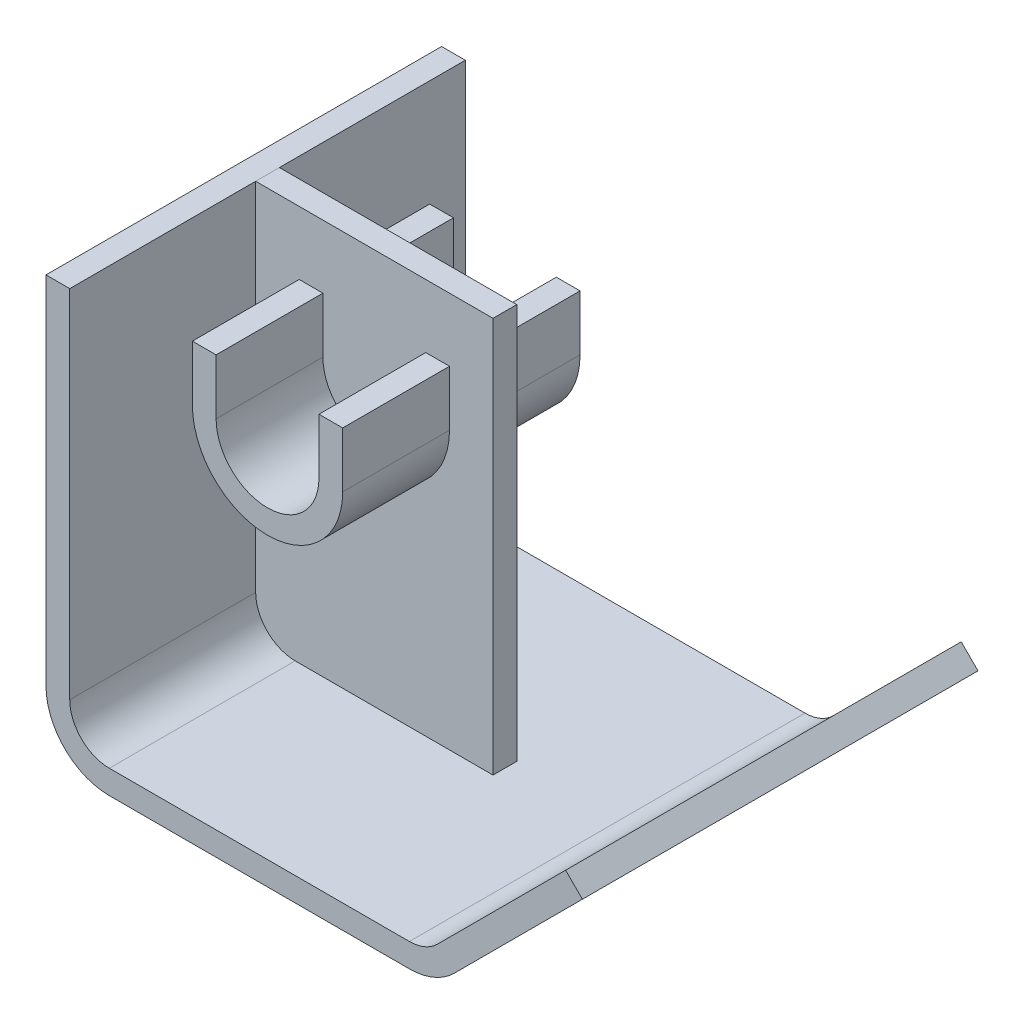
ISO-10303-21;
HEADER;
FILE_DESCRIPTION(('STEP AP214'),'2;1');
FILE_NAME('part.step','',(''),(''),'','','');
FILE_SCHEMA(('AUTOMOTIVE_DESIGN { 1 0 10303 214 1 1 1 1 }'));
ENDSEC;
DATA;
#1=APPLICATION_CONTEXT('core data for automotive mechanical design processes');
#2=APPLICATION_PROTOCOL_DEFINITION('international standard','automotive_design',2000,#1);
#3=PRODUCT_CONTEXT('',#1,'mechanical');
#4=PRODUCT('Part','Part','',(#3));
#5=PRODUCT_RELATED_PRODUCT_CATEGORY('part','',(#4));
#6=PRODUCT_DEFINITION_FORMATION('','',#4);
#7=PRODUCT_DEFINITION_CONTEXT('part definition',#1,'design');
#8=PRODUCT_DEFINITION('design','',#6,#7);
#9=PRODUCT_DEFINITION_SHAPE('','',#8);
#10=(LENGTH_UNIT() NAMED_UNIT(*) SI_UNIT(.MILLI.,.METRE.));
#11=(NAMED_UNIT(*) PLANE_ANGLE_UNIT() SI_UNIT($,.RADIAN.));
#12=(NAMED_UNIT(*) SI_UNIT($,.STERADIAN.) SOLID_ANGLE_UNIT());
#13=UNCERTAINTY_MEASURE_WITH_UNIT(LENGTH_MEASURE(1.E-05),#10,'distance_accuracy_value','');
#14=(GEOMETRIC_REPRESENTATION_CONTEXT(3) GLOBAL_UNCERTAINTY_ASSIGNED_CONTEXT((#13)) GLOBAL_UNIT_ASSIGNED_CONTEXT((#10,
#11,#12)) REPRESENTATION_CONTEXT('',''));
#15=CARTESIAN_POINT('',(0.,0.,0.));
#16=DIRECTION('',(0.,0.,1.));
#17=DIRECTION('',(1.,0.,0.));
#18=AXIS2_PLACEMENT_3D('',#15,#16,#17);
#19=CARTESIAN_POINT('',(24.5,35.,15.));
#20=DIRECTION('',(-1.,0.,0.));
#21=DIRECTION('',(0.,0.,1.));
#22=AXIS2_PLACEMENT_3D('',#19,#20,#21);
#23=PLANE('',#22);
#24=DIRECTION('',(0.,1.,0.));
#25=VECTOR('',#24,1.);
#26=CARTESIAN_POINT('',(24.5,35.,-15.));
#27=LINE('',#26,#25);
#28=CARTESIAN_POINT('',(24.5,35.,-15.));
#29=VERTEX_POINT('',#28);
#30=CARTESIAN_POINT('',(24.5,42.,-15.));
#31=VERTEX_POINT('',#30);
#32=EDGE_CURVE('E119',#29,#31,#27,.T.);
#33=ORIENTED_EDGE('',*,*,#32,.T.);
#34=DIRECTION('',(0.,0.,-1.));
#35=VECTOR('',#34,1.);
#36=CARTESIAN_POINT('',(24.5,42.,15.));
#37=LINE('',#36,#35);
#38=CARTESIAN_POINT('',(24.5,42.,15.));
#39=VERTEX_POINT('',#38);
#40=EDGE_CURVE('E12',#39,#31,#37,.T.);
#41=ORIENTED_EDGE('',*,*,#40,.F.);
#42=DIRECTION('',(0.,1.,0.));
#43=VECTOR('',#42,1.);
#44=CARTESIAN_POINT('',(24.5,35.,15.));
#45=LINE('',#44,#43);
#46=CARTESIAN_POINT('',(24.5,35.,15.));
#47=VERTEX_POINT('',#46);
#48=EDGE_CURVE('E143',#47,#39,#45,.T.);
#49=ORIENTED_EDGE('',*,*,#48,.F.);
#50=DIRECTION('',(0.,0.,-1.));
#51=VECTOR('',#50,1.);
#52=CARTESIAN_POINT('',(24.5,35.,15.));
#53=LINE('',#52,#51);
#54=EDGE_CURVE('E120',#47,#29,#53,.T.);
#55=ORIENTED_EDGE('',*,*,#54,.T.);
#56=EDGE_LOOP('',(#33,#41,#49,#55));
#57=FACE_BOUND('',#56,.T.);
#58=ADVANCED_FACE('F44',(#57),#23,.F.);
#59=CARTESIAN_POINT('',(21.5,42.,15.));
#60=DIRECTION('',(0.,1.,0.));
#61=DIRECTION('',(0.,0.,1.));
#62=AXIS2_PLACEMENT_3D('',#59,#60,#61);
#63=PLANE('',#62);
#64=DIRECTION('',(1.,0.,0.));
#65=VECTOR('',#64,1.);
#66=CARTESIAN_POINT('',(21.5,42.,-15.));
#67=LINE('',#66,#65);
#68=CARTESIAN_POINT('',(21.5,42.,-15.));
#69=VERTEX_POINT('',#68);
#70=EDGE_CURVE('E111',#69,#31,#67,.T.);
#71=ORIENTED_EDGE('',*,*,#70,.F.);
#72=DIRECTION('',(0.,0.,-1.));
#73=VECTOR('',#72,1.);
#74=CARTESIAN_POINT('',(21.5,42.,15.));
#75=LINE('',#74,#73);
#76=CARTESIAN_POINT('',(21.5,42.,15.));
#77=VERTEX_POINT('',#76);
#78=EDGE_CURVE('E51',#77,#69,#75,.T.);
#79=ORIENTED_EDGE('',*,*,#78,.F.);
#80=DIRECTION('',(1.,0.,0.));
#81=VECTOR('',#80,1.);
#82=CARTESIAN_POINT('',(21.5,42.,15.));
#83=LINE('',#82,#81);
#84=EDGE_CURVE('E114',#77,#39,#83,.T.);
#85=ORIENTED_EDGE('',*,*,#84,.T.);
#86=ORIENTED_EDGE('',*,*,#40,.T.);
#87=EDGE_LOOP('',(#71,#79,#85,#86));
#88=FACE_BOUND('',#87,.T.);
#89=ADVANCED_FACE('F109',(#88),#63,.T.);
#90=CARTESIAN_POINT('',(21.5,35.,15.));
#91=DIRECTION('',(-1.,0.,0.));
#92=DIRECTION('',(0.,0.,1.));
#93=AXIS2_PLACEMENT_3D('',#90,#91,#92);
#94=PLANE('',#93);
#95=DIRECTION('',(0.,1.,0.));
#96=VECTOR('',#95,1.);
#97=CARTESIAN_POINT('',(21.5,35.,-15.));
#98=LINE('',#97,#96);
#99=CARTESIAN_POINT('',(21.5,35.,-15.));
#100=VERTEX_POINT('',#99);
#101=EDGE_CURVE('E127',#100,#69,#98,.T.);
#102=ORIENTED_EDGE('',*,*,#101,.F.);
#103=DIRECTION('',(0.,0.,-1.));
#104=VECTOR('',#103,1.);
#105=CARTESIAN_POINT('',(21.5,35.,15.));
#106=LINE('',#105,#104);
#107=CARTESIAN_POINT('',(21.5,35.,15.));
#108=VERTEX_POINT('',#107);
#109=EDGE_CURVE('E170',#108,#100,#106,.T.);
#110=ORIENTED_EDGE('',*,*,#109,.F.);
#111=DIRECTION('',(0.,1.,0.));
#112=VECTOR('',#111,1.);
#113=CARTESIAN_POINT('',(21.5,35.,15.));
#114=LINE('',#113,#112);
#115=EDGE_CURVE('E146',#108,#77,#114,.T.);
#116=ORIENTED_EDGE('',*,*,#115,.T.);
#117=ORIENTED_EDGE('',*,*,#78,.T.);
#118=EDGE_LOOP('',(#102,#110,#116,#117));
#119=FACE_BOUND('',#118,.T.);
#120=ADVANCED_FACE('F172',(#119),#94,.T.);
#121=CARTESIAN_POINT('',(15.,35.,15.));
#122=DIRECTION('',(0.,0.,-1.));
#123=DIRECTION('',(-1.,0.,0.));
#124=AXIS2_PLACEMENT_3D('',#121,#122,#123);
#125=CYLINDRICAL_SURFACE('',#124,6.5);
#126=CARTESIAN_POINT('',(15.,35.,-15.));
#127=DIRECTION('',(0.,0.,1.));
#128=DIRECTION('',(1.,0.,0.));
#129=AXIS2_PLACEMENT_3D('',#126,#127,#128);
#130=CIRCLE('',#129,6.5);
#131=CARTESIAN_POINT('',(8.5,35.,-15.));
#132=VERTEX_POINT('',#131);
#133=EDGE_CURVE('E129',#132,#100,#130,.T.);
#134=ORIENTED_EDGE('',*,*,#133,.F.);
#135=DIRECTION('',(0.,0.,-1.));
#136=VECTOR('',#135,1.);
#137=CARTESIAN_POINT('',(8.5,35.,15.));
#138=LINE('',#137,#136);
#139=CARTESIAN_POINT('',(8.5,35.,15.));
#140=VERTEX_POINT('',#139);
#141=EDGE_CURVE('E168',#140,#132,#138,.T.);
#142=ORIENTED_EDGE('',*,*,#141,.F.);
#143=CARTESIAN_POINT('',(15.,35.,15.));
#144=DIRECTION('',(0.,0.,1.));
#145=DIRECTION('',(1.,0.,0.));
#146=AXIS2_PLACEMENT_3D('',#143,#144,#145);
#147=CIRCLE('',#146,6.5);
#148=EDGE_CURVE('E149',#140,#108,#147,.T.);
#149=ORIENTED_EDGE('',*,*,#148,.T.);
#150=ORIENTED_EDGE('',*,*,#109,.T.);
#151=EDGE_LOOP('',(#134,#142,#149,#150));
#152=FACE_BOUND('',#151,.T.);
#153=ADVANCED_FACE('F179',(#152),#125,.F.);
#154=CARTESIAN_POINT('',(8.5,42.,15.));
#155=DIRECTION('',(1.,0.,0.));
#156=DIRECTION('',(0.,1.,0.));
#157=AXIS2_PLACEMENT_3D('',#154,#155,#156);
#158=PLANE('',#157);
#159=DIRECTION('',(0.,-1.,0.));
#160=VECTOR('',#159,1.);
#161=CARTESIAN_POINT('',(8.5,42.,-15.));
#162=LINE('',#161,#160);
#163=CARTESIAN_POINT('',(8.5,42.,-15.));
#164=VERTEX_POINT('',#163);
#165=EDGE_CURVE('E133',#164,#132,#162,.T.);
#166=ORIENTED_EDGE('',*,*,#165,.F.);
#167=DIRECTION('',(0.,0.,-1.));
#168=VECTOR('',#167,1.);
#169=CARTESIAN_POINT('',(8.5,42.,15.));
#170=LINE('',#169,#168);
#171=CARTESIAN_POINT('',(8.5,42.,15.));
#172=VERTEX_POINT('',#171);
#173=EDGE_CURVE('E166',#172,#164,#170,.T.);
#174=ORIENTED_EDGE('',*,*,#173,.F.);
#175=DIRECTION('',(0.,-1.,0.));
#176=VECTOR('',#175,1.);
#177=CARTESIAN_POINT('',(8.5,42.,15.));
#178=LINE('',#177,#176);
#179=EDGE_CURVE('E152',#172,#140,#178,.T.);
#180=ORIENTED_EDGE('',*,*,#179,.T.);
#181=ORIENTED_EDGE('',*,*,#141,.T.);
#182=EDGE_LOOP('',(#166,#174,#180,#181));
#183=FACE_BOUND('',#182,.T.);
#184=ADVANCED_FACE('F182',(#183),#158,.T.);
#185=CARTESIAN_POINT('',(5.5,42.,15.));
#186=DIRECTION('',(0.,1.,0.));
#187=DIRECTION('',(0.,0.,1.));
#188=AXIS2_PLACEMENT_3D('',#185,#186,#187);
#189=PLANE('',#188);
#190=DIRECTION('',(1.,0.,0.));
#191=VECTOR('',#190,1.);
#192=CARTESIAN_POINT('',(5.5,42.,-15.));
#193=LINE('',#192,#191);
#194=CARTESIAN_POINT('',(5.5,42.,-15.));
#195=VERTEX_POINT('',#194);
#196=EDGE_CURVE('E136',#195,#164,#193,.T.);
#197=ORIENTED_EDGE('',*,*,#196,.F.);
#198=DIRECTION('',(0.,0.,-1.));
#199=VECTOR('',#198,1.);
#200=CARTESIAN_POINT('',(5.5,42.,15.));
#201=LINE('',#200,#199);
#202=CARTESIAN_POINT('',(5.5,42.,15.));
#203=VERTEX_POINT('',#202);
#204=EDGE_CURVE('E164',#203,#195,#201,.T.);
#205=ORIENTED_EDGE('',*,*,#204,.F.);
#206=DIRECTION('',(1.,0.,0.));
#207=VECTOR('',#206,1.);
#208=CARTESIAN_POINT('',(5.5,42.,15.));
#209=LINE('',#208,#207);
#210=EDGE_CURVE('E155',#203,#172,#209,.T.);
#211=ORIENTED_EDGE('',*,*,#210,.T.);
#212=ORIENTED_EDGE('',*,*,#173,.T.);
#213=EDGE_LOOP('',(#197,#205,#211,#212));
#214=FACE_BOUND('',#213,.T.);
#215=ADVANCED_FACE('F185',(#214),#189,.T.);
#216=CARTESIAN_POINT('',(5.5,42.,15.));
#217=DIRECTION('',(1.,0.,0.));
#218=DIRECTION('',(0.,1.,0.));
#219=AXIS2_PLACEMENT_3D('',#216,#217,#218);
#220=PLANE('',#219);
#221=DIRECTION('',(0.,-1.,0.));
#222=VECTOR('',#221,1.);
#223=CARTESIAN_POINT('',(5.5,42.,-15.));
#224=LINE('',#223,#222);
#225=CARTESIAN_POINT('',(5.5,35.,-15.));
#226=VERTEX_POINT('',#225);
#227=EDGE_CURVE('E139',#195,#226,#224,.T.);
#228=ORIENTED_EDGE('',*,*,#227,.T.);
#229=DIRECTION('',(0.,0.,-1.));
#230=VECTOR('',#229,1.);
#231=CARTESIAN_POINT('',(5.5,35.,15.));
#232=LINE('',#231,#230);
#233=CARTESIAN_POINT('',(5.5,35.,15.));
#234=VERTEX_POINT('',#233);
#235=EDGE_CURVE('E161',#234,#226,#232,.T.);
#236=ORIENTED_EDGE('',*,*,#235,.F.);
#237=DIRECTION('',(0.,-1.,0.));
#238=VECTOR('',#237,1.);
#239=CARTESIAN_POINT('',(5.5,42.,15.));
#240=LINE('',#239,#238);
#241=EDGE_CURVE('E63',#203,#234,#240,.T.);
#242=ORIENTED_EDGE('',*,*,#241,.F.);
#243=ORIENTED_EDGE('',*,*,#204,.T.);
#244=EDGE_LOOP('',(#228,#236,#242,#243));
#245=FACE_BOUND('',#244,.T.);
#246=ADVANCED_FACE('F188',(#245),#220,.F.);
#247=CARTESIAN_POINT('',(15.,35.,15.));
#248=DIRECTION('',(0.,0.,-1.));
#249=DIRECTION('',(-1.,0.,0.));
#250=AXIS2_PLACEMENT_3D('',#247,#248,#249);
#251=CYLINDRICAL_SURFACE('',#250,9.5);
#252=CARTESIAN_POINT('',(15.,35.,-15.));
#253=DIRECTION('',(0.,0.,1.));
#254=DIRECTION('',(1.,0.,0.));
#255=AXIS2_PLACEMENT_3D('',#252,#253,#254);
#256=CIRCLE('',#255,9.5);
#257=EDGE_CURVE('E141',#226,#29,#256,.T.);
#258=ORIENTED_EDGE('',*,*,#257,.T.);
#259=ORIENTED_EDGE('',*,*,#54,.F.);
#260=CARTESIAN_POINT('',(15.,35.,15.));
#261=DIRECTION('',(0.,0.,1.));
#262=DIRECTION('',(1.,0.,0.));
#263=AXIS2_PLACEMENT_3D('',#260,#261,#262);
#264=CIRCLE('',#263,9.5);
#265=EDGE_CURVE('E58',#234,#47,#264,.T.);
#266=ORIENTED_EDGE('',*,*,#265,.F.);
#267=ORIENTED_EDGE('',*,*,#235,.T.);
#268=EDGE_LOOP('',(#258,#259,#266,#267));
#269=FACE_BOUND('',#268,.T.);
#270=ADVANCED_FACE('F190',(#269),#251,.T.);
#271=CARTESIAN_POINT('',(15.,35.,15.));
#272=DIRECTION('',(0.,0.,1.));
#273=DIRECTION('',(1.,0.,0.));
#274=AXIS2_PLACEMENT_3D('',#271,#272,#273);
#275=PLANE('',#274);
#276=ORIENTED_EDGE('',*,*,#48,.T.);
#277=ORIENTED_EDGE('',*,*,#84,.F.);
#278=ORIENTED_EDGE('',*,*,#115,.F.);
#279=ORIENTED_EDGE('',*,*,#148,.F.);
#280=ORIENTED_EDGE('',*,*,#179,.F.);
#281=ORIENTED_EDGE('',*,*,#210,.F.);
#282=ORIENTED_EDGE('',*,*,#241,.T.);
#283=ORIENTED_EDGE('',*,*,#265,.T.);
#284=EDGE_LOOP('',(#276,#277,#278,#279,#280,#281,#282,#283));
#285=FACE_BOUND('',#284,.T.);
#286=ADVANCED_FACE('F174',(#285),#275,.T.);
#287=CARTESIAN_POINT('',(15.,35.,-15.));
#288=DIRECTION('',(0.,0.,1.));
#289=DIRECTION('',(1.,0.,0.));
#290=AXIS2_PLACEMENT_3D('',#287,#288,#289);
#291=PLANE('',#290);
#292=ORIENTED_EDGE('',*,*,#32,.F.);
#293=ORIENTED_EDGE('',*,*,#257,.F.);
#294=ORIENTED_EDGE('',*,*,#227,.F.);
#295=ORIENTED_EDGE('',*,*,#196,.T.);
#296=ORIENTED_EDGE('',*,*,#165,.T.);
#297=ORIENTED_EDGE('',*,*,#133,.T.);
#298=ORIENTED_EDGE('',*,*,#101,.T.);
#299=ORIENTED_EDGE('',*,*,#70,.T.);
#300=EDGE_LOOP('',(#292,#293,#294,#295,#296,#297,#298,#299));
#301=FACE_BOUND('',#300,.T.);
#302=ADVANCED_FACE('F124',(#301),#291,.F.);
#303=CLOSED_SHELL('',(#58,#89,#120,#153,#184,#215,#246,#270,#286,#302));
#304=MANIFOLD_SOLID_BREP('B2',#303);
#305=CARTESIAN_POINT('',(30.,50.,1.5));
#306=DIRECTION('',(0.,0.,-1.));
#307=DIRECTION('',(-1.,0.,0.));
#308=AXIS2_PLACEMENT_3D('',#305,#306,#307);
#309=PLANE('',#308);
#310=DIRECTION('',(0.,1.,0.));
#311=VECTOR('',#310,1.);
#312=CARTESIAN_POINT('',(0.,50.,1.5));
#313=LINE('',#312,#311);
#314=CARTESIAN_POINT('',(0.,50.,1.5));
#315=VERTEX_POINT('',#314);
#316=CARTESIAN_POINT('',(0.,0.,1.5));
#317=VERTEX_POINT('',#316);
#318=EDGE_CURVE('E332',#315,#317,#313,.F.);
#319=ORIENTED_EDGE('',*,*,#318,.T.);
#320=DIRECTION('',(-1.,0.,0.));
#321=VECTOR('',#320,1.);
#322=CARTESIAN_POINT('',(30.,0.,1.5));
#323=LINE('',#322,#321);
#324=CARTESIAN_POINT('',(30.,0.,1.5));
#325=VERTEX_POINT('',#324);
#326=EDGE_CURVE('E42',#325,#317,#323,.T.);
#327=ORIENTED_EDGE('',*,*,#326,.F.);
#328=DIRECTION('',(0.,1.,0.));
#329=VECTOR('',#328,1.);
#330=CARTESIAN_POINT('',(30.,50.,1.5));
#331=LINE('',#330,#329);
#332=CARTESIAN_POINT('',(30.,50.,1.5));
#333=VERTEX_POINT('',#332);
#334=EDGE_CURVE('E343',#333,#325,#331,.F.);
#335=ORIENTED_EDGE('',*,*,#334,.F.);
#336=DIRECTION('',(-1.,0.,0.));
#337=VECTOR('',#336,1.);
#338=CARTESIAN_POINT('',(30.,50.,1.5));
#339=LINE('',#338,#337);
#340=EDGE_CURVE('E295',#333,#315,#339,.T.);
#341=ORIENTED_EDGE('',*,*,#340,.T.);
#342=EDGE_LOOP('',(#319,#327,#335,#341));
#343=FACE_BOUND('',#342,.T.);
#344=ADVANCED_FACE('F281',(#343),#309,.F.);
#345=CARTESIAN_POINT('',(30.,0.,-1.5));
#346=DIRECTION('',(0.,-1.,0.));
#347=DIRECTION('',(0.,0.,-1.));
#348=AXIS2_PLACEMENT_3D('',#345,#346,#347);
#349=PLANE('',#348);
#350=DIRECTION('',(0.,0.,1.));
#351=VECTOR('',#350,1.);
#352=CARTESIAN_POINT('',(0.,0.,-1.5));
#353=LINE('',#352,#351);
#354=CARTESIAN_POINT('',(0.,0.,-1.5));
#355=VERTEX_POINT('',#354);
#356=EDGE_CURVE('E326',#355,#317,#353,.T.);
#357=ORIENTED_EDGE('',*,*,#356,.F.);
#358=DIRECTION('',(-1.,0.,0.));
#359=VECTOR('',#358,1.);
#360=CARTESIAN_POINT('',(30.,0.,-1.5));
#361=LINE('',#360,#359);
#362=CARTESIAN_POINT('',(30.,0.,-1.5));
#363=VERTEX_POINT('',#362);
#364=EDGE_CURVE('E288',#363,#355,#361,.T.);
#365=ORIENTED_EDGE('',*,*,#364,.F.);
#366=DIRECTION('',(0.,0.,1.));
#367=VECTOR('',#366,1.);
#368=CARTESIAN_POINT('',(30.,0.,-1.5));
#369=LINE('',#368,#367);
#370=EDGE_CURVE('E329',#363,#325,#369,.T.);
#371=ORIENTED_EDGE('',*,*,#370,.T.);
#372=ORIENTED_EDGE('',*,*,#326,.T.);
#373=EDGE_LOOP('',(#357,#365,#371,#372));
#374=FACE_BOUND('',#373,.T.);
#375=ADVANCED_FACE('F324',(#374),#349,.T.);
#376=CARTESIAN_POINT('',(30.,50.,-1.5));
#377=DIRECTION('',(0.,0.,-1.));
#378=DIRECTION('',(-1.,0.,0.));
#379=AXIS2_PLACEMENT_3D('',#376,#377,#378);
#380=PLANE('',#379);
#381=DIRECTION('',(0.,1.,0.));
#382=VECTOR('',#381,1.);
#383=CARTESIAN_POINT('',(0.,50.,-1.5));
#384=LINE('',#383,#382);
#385=CARTESIAN_POINT('',(0.,50.,-1.5));
#386=VERTEX_POINT('',#385);
#387=EDGE_CURVE('E337',#386,#355,#384,.F.);
#388=ORIENTED_EDGE('',*,*,#387,.F.);
#389=DIRECTION('',(-1.,0.,0.));
#390=VECTOR('',#389,1.);
#391=CARTESIAN_POINT('',(30.,50.,-1.5));
#392=LINE('',#391,#390);
#393=CARTESIAN_POINT('',(30.,50.,-1.5));
#394=VERTEX_POINT('',#393);
#395=EDGE_CURVE('E303',#394,#386,#392,.T.);
#396=ORIENTED_EDGE('',*,*,#395,.F.);
#397=DIRECTION('',(0.,1.,0.));
#398=VECTOR('',#397,1.);
#399=CARTESIAN_POINT('',(30.,50.,-1.5));
#400=LINE('',#399,#398);
#401=EDGE_CURVE('E346',#394,#363,#400,.F.);
#402=ORIENTED_EDGE('',*,*,#401,.T.);
#403=ORIENTED_EDGE('',*,*,#364,.T.);
#404=EDGE_LOOP('',(#388,#396,#402,#403));
#405=FACE_BOUND('',#404,.T.);
#406=ADVANCED_FACE('F351',(#405),#380,.T.);
#407=CARTESIAN_POINT('',(30.,50.,1.5));
#408=DIRECTION('',(0.,1.,0.));
#409=DIRECTION('',(0.,0.,1.));
#410=AXIS2_PLACEMENT_3D('',#407,#408,#409);
#411=PLANE('',#410);
#412=DIRECTION('',(0.,0.,-1.));
#413=VECTOR('',#412,1.);
#414=CARTESIAN_POINT('',(0.,50.,1.5));
#415=LINE('',#414,#413);
#416=EDGE_CURVE('E339',#315,#386,#415,.T.);
#417=ORIENTED_EDGE('',*,*,#416,.F.);
#418=ORIENTED_EDGE('',*,*,#340,.F.);
#419=DIRECTION('',(0.,0.,-1.));
#420=VECTOR('',#419,1.);
#421=CARTESIAN_POINT('',(30.,50.,1.5));
#422=LINE('',#421,#420);
#423=EDGE_CURVE('E348',#333,#394,#422,.T.);
#424=ORIENTED_EDGE('',*,*,#423,.T.);
#425=ORIENTED_EDGE('',*,*,#395,.T.);
#426=EDGE_LOOP('',(#417,#418,#424,#425));
#427=FACE_BOUND('',#426,.T.);
#428=ADVANCED_FACE('F355',(#427),#411,.T.);
#429=CARTESIAN_POINT('',(30.,0.,1.5));
#430=DIRECTION('',(1.,0.,0.));
#431=DIRECTION('',(0.,0.,-1.));
#432=AXIS2_PLACEMENT_3D('',#429,#430,#431);
#433=PLANE('',#432);
#434=ORIENTED_EDGE('',*,*,#334,.T.);
#435=ORIENTED_EDGE('',*,*,#370,.F.);
#436=ORIENTED_EDGE('',*,*,#401,.F.);
#437=ORIENTED_EDGE('',*,*,#423,.F.);
#438=EDGE_LOOP('',(#434,#435,#436,#437));
#439=FACE_BOUND('',#438,.T.);
#440=ADVANCED_FACE('F353',(#439),#433,.T.);
#441=CARTESIAN_POINT('',(0.,0.,1.5));
#442=DIRECTION('',(1.,0.,0.));
#443=DIRECTION('',(0.,0.,-1.));
#444=AXIS2_PLACEMENT_3D('',#441,#442,#443);
#445=PLANE('',#444);
#446=ORIENTED_EDGE('',*,*,#318,.F.);
#447=ORIENTED_EDGE('',*,*,#416,.T.);
#448=ORIENTED_EDGE('',*,*,#387,.T.);
#449=ORIENTED_EDGE('',*,*,#356,.T.);
#450=EDGE_LOOP('',(#446,#447,#448,#449));
#451=FACE_BOUND('',#450,.T.);
#452=ADVANCED_FACE('F336',(#451),#445,.F.);
#453=CLOSED_SHELL('',(#344,#375,#406,#428,#440,#452));
#454=MANIFOLD_SOLID_BREP('B6',#453);
#455=CARTESIAN_POINT('',(48.5857864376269,-0.656854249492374,25.));
#456=DIRECTION('',(-0.707106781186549,0.707106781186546,0.));
#457=DIRECTION('',(-0.707106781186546,-0.707106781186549,0.));
#458=AXIS2_PLACEMENT_3D('',#455,#456,#457);
#459=PLANE('',#458);
#460=DIRECTION('',(0.707106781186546,0.707106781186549,0.));
#461=VECTOR('',#460,1.);
#462=CARTESIAN_POINT('',(48.5857864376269,-0.656854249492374,-25.));
#463=LINE('',#462,#461);
#464=CARTESIAN_POINT('',(48.5857864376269,-0.656854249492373,-25.));
#465=VERTEX_POINT('',#464);
#466=CARTESIAN_POINT('',(64.7989898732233,15.5563491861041,-25.));
#467=VERTEX_POINT('',#466);
#468=EDGE_CURVE('E503',#465,#467,#463,.T.);
#469=ORIENTED_EDGE('',*,*,#468,.T.);
#470=DIRECTION('',(0.,0.,-1.));
#471=VECTOR('',#470,1.);
#472=CARTESIAN_POINT('',(64.7989898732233,15.5563491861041,25.));
#473=LINE('',#472,#471);
#474=CARTESIAN_POINT('',(64.7989898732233,15.5563491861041,25.));
#475=VERTEX_POINT('',#474);
#476=EDGE_CURVE('E279',#475,#467,#473,.T.);
#477=ORIENTED_EDGE('',*,*,#476,.F.);
#478=DIRECTION('',(0.707106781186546,0.707106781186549,0.));
#479=VECTOR('',#478,1.);
#480=CARTESIAN_POINT('',(48.5857864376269,-0.656854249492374,25.));
#481=LINE('',#480,#479);
#482=CARTESIAN_POINT('',(48.5857864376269,-0.656854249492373,25.));
#483=VERTEX_POINT('',#482);
#484=EDGE_CURVE('E537',#483,#475,#481,.T.);
#485=ORIENTED_EDGE('',*,*,#484,.F.);
#486=DIRECTION('',(0.,0.,-1.));
#487=VECTOR('',#486,1.);
#488=CARTESIAN_POINT('',(48.5857864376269,-0.656854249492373,25.));
#489=LINE('',#488,#487);
#490=EDGE_CURVE('E504',#483,#465,#489,.T.);
#491=ORIENTED_EDGE('',*,*,#490,.T.);
#492=EDGE_LOOP('',(#469,#477,#485,#491));
#493=FACE_BOUND('',#492,.T.);
#494=ADVANCED_FACE('F405',(#493),#459,.F.);
#495=CARTESIAN_POINT('',(62.6776695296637,17.6776695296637,25.));
#496=DIRECTION('',(0.707106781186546,0.707106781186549,0.));
#497=DIRECTION('',(-0.707106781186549,0.707106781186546,0.));
#498=AXIS2_PLACEMENT_3D('',#495,#496,#497);
#499=PLANE('',#498);
#500=DIRECTION('',(0.707106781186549,-0.707106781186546,0.));
#501=VECTOR('',#500,1.);
#502=CARTESIAN_POINT('',(62.6776695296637,17.6776695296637,-25.));
#503=LINE('',#502,#501);
#504=CARTESIAN_POINT('',(62.6776695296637,17.6776695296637,-25.));
#505=VERTEX_POINT('',#504);
#506=EDGE_CURVE('E495',#505,#467,#503,.T.);
#507=ORIENTED_EDGE('',*,*,#506,.F.);
#508=DIRECTION('',(0.,0.,-1.));
#509=VECTOR('',#508,1.);
#510=CARTESIAN_POINT('',(62.6776695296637,17.6776695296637,25.));
#511=LINE('',#510,#509);
#512=CARTESIAN_POINT('',(62.6776695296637,17.6776695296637,25.));
#513=VERTEX_POINT('',#512);
#514=EDGE_CURVE('E412',#513,#505,#511,.T.);
#515=ORIENTED_EDGE('',*,*,#514,.F.);
#516=DIRECTION('',(0.707106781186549,-0.707106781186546,0.));
#517=VECTOR('',#516,1.);
#518=CARTESIAN_POINT('',(62.6776695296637,17.6776695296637,25.));
#519=LINE('',#518,#517);
#520=EDGE_CURVE('E498',#513,#475,#519,.T.);
#521=ORIENTED_EDGE('',*,*,#520,.T.);
#522=ORIENTED_EDGE('',*,*,#476,.T.);
#523=EDGE_LOOP('',(#507,#515,#521,#522));
#524=FACE_BOUND('',#523,.T.);
#525=ADVANCED_FACE('F493',(#524),#499,.T.);
#526=CARTESIAN_POINT('',(46.4644660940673,1.46446609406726,25.));
#527=DIRECTION('',(-0.707106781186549,0.707106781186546,0.));
#528=DIRECTION('',(-0.707106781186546,-0.707106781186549,0.));
#529=AXIS2_PLACEMENT_3D('',#526,#527,#528);
#530=PLANE('',#529);
#531=DIRECTION('',(0.707106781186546,0.707106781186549,0.));
#532=VECTOR('',#531,1.);
#533=CARTESIAN_POINT('',(46.4644660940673,1.46446609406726,-25.));
#534=LINE('',#533,#532);
#535=CARTESIAN_POINT('',(46.4644660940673,1.46446609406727,-25.));
#536=VERTEX_POINT('',#535);
#537=EDGE_CURVE('E511',#536,#505,#534,.T.);
#538=ORIENTED_EDGE('',*,*,#537,.F.);
#539=DIRECTION('',(0.,0.,-1.));
#540=VECTOR('',#539,1.);
#541=CARTESIAN_POINT('',(46.4644660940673,1.46446609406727,25.));
#542=LINE('',#541,#540);
#543=CARTESIAN_POINT('',(46.4644660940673,1.46446609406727,25.));
#544=VERTEX_POINT('',#543);
#545=EDGE_CURVE('E584',#544,#536,#542,.T.);
#546=ORIENTED_EDGE('',*,*,#545,.F.);
#547=DIRECTION('',(0.707106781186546,0.707106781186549,0.));
#548=VECTOR('',#547,1.);
#549=CARTESIAN_POINT('',(46.4644660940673,1.46446609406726,25.));
#550=LINE('',#549,#548);
#551=EDGE_CURVE('E540',#544,#513,#550,.T.);
#552=ORIENTED_EDGE('',*,*,#551,.T.);
#553=ORIENTED_EDGE('',*,*,#514,.T.);
#554=EDGE_LOOP('',(#538,#546,#552,#553));
#555=FACE_BOUND('',#554,.T.);
#556=ADVANCED_FACE('F586',(#555),#530,.T.);
#557=CARTESIAN_POINT('',(42.9289321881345,5.,25.));
#558=DIRECTION('',(0.,0.,-1.));
#559=DIRECTION('',(-1.,0.,0.));
#560=AXIS2_PLACEMENT_3D('',#557,#558,#559);
#561=CYLINDRICAL_SURFACE('',#560,5.);
#562=CARTESIAN_POINT('',(42.9289321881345,5.,-25.));
#563=DIRECTION('',(0.,0.,1.));
#564=DIRECTION('',(1.,0.,0.));
#565=AXIS2_PLACEMENT_3D('',#562,#563,#564);
#566=CIRCLE('',#565,5.);
#567=CARTESIAN_POINT('',(42.9289321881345,0.,-25.));
#568=VERTEX_POINT('',#567);
#569=EDGE_CURVE('E513',#568,#536,#566,.T.);
#570=ORIENTED_EDGE('',*,*,#569,.F.);
#571=DIRECTION('',(0.,0.,-1.));
#572=VECTOR('',#571,1.);
#573=CARTESIAN_POINT('',(42.9289321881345,0.,25.));
#574=LINE('',#573,#572);
#575=CARTESIAN_POINT('',(42.9289321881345,0.,25.));
#576=VERTEX_POINT('',#575);
#577=EDGE_CURVE('E582',#576,#568,#574,.T.);
#578=ORIENTED_EDGE('',*,*,#577,.F.);
#579=CARTESIAN_POINT('',(42.9289321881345,5.,25.));
#580=DIRECTION('',(0.,0.,1.));
#581=DIRECTION('',(1.,0.,0.));
#582=AXIS2_PLACEMENT_3D('',#579,#580,#581);
#583=CIRCLE('',#582,5.);
#584=EDGE_CURVE('E543',#576,#544,#583,.T.);
#585=ORIENTED_EDGE('',*,*,#584,.T.);
#586=ORIENTED_EDGE('',*,*,#545,.T.);
#587=EDGE_LOOP('',(#570,#578,#585,#586));
#588=FACE_BOUND('',#587,.T.);
#589=ADVANCED_FACE('F593',(#588),#561,.F.);
#590=CARTESIAN_POINT('',(5.,0.,25.));
#591=DIRECTION('',(0.,1.,0.));
#592=DIRECTION('',(0.,0.,1.));
#593=AXIS2_PLACEMENT_3D('',#590,#591,#592);
#594=PLANE('',#593);
#595=DIRECTION('',(1.,0.,0.));
#596=VECTOR('',#595,1.);
#597=CARTESIAN_POINT('',(5.,0.,-25.));
#598=LINE('',#597,#596);
#599=CARTESIAN_POINT('',(5.,0.,-25.));
#600=VERTEX_POINT('',#599);
#601=EDGE_CURVE('E517',#600,#568,#598,.T.);
#602=ORIENTED_EDGE('',*,*,#601,.F.);
#603=DIRECTION('',(0.,0.,-1.));
#604=VECTOR('',#603,1.);
#605=CARTESIAN_POINT('',(5.,0.,25.));
#606=LINE('',#605,#604);
#607=CARTESIAN_POINT('',(5.,0.,25.));
#608=VERTEX_POINT('',#607);
#609=EDGE_CURVE('E580',#608,#600,#606,.T.);
#610=ORIENTED_EDGE('',*,*,#609,.F.);
#611=DIRECTION('',(1.,0.,0.));
#612=VECTOR('',#611,1.);
#613=CARTESIAN_POINT('',(5.,0.,25.));
#614=LINE('',#613,#612);
#615=EDGE_CURVE('E546',#608,#576,#614,.T.);
#616=ORIENTED_EDGE('',*,*,#615,.T.);
#617=ORIENTED_EDGE('',*,*,#577,.T.);
#618=EDGE_LOOP('',(#602,#610,#616,#617));
#619=FACE_BOUND('',#618,.T.);
#620=ADVANCED_FACE('F596',(#619),#594,.T.);
#621=CARTESIAN_POINT('',(5.,5.,25.));
#622=DIRECTION('',(0.,0.,-1.));
#623=DIRECTION('',(-1.,0.,0.));
#624=AXIS2_PLACEMENT_3D('',#621,#622,#623);
#625=CYLINDRICAL_SURFACE('',#624,5.);
#626=CARTESIAN_POINT('',(5.,5.,-25.));
#627=DIRECTION('',(0.,0.,1.));
#628=DIRECTION('',(1.,0.,0.));
#629=AXIS2_PLACEMENT_3D('',#626,#627,#628);
#630=CIRCLE('',#629,5.);
#631=CARTESIAN_POINT('',(0.,5.,-25.));
#632=VERTEX_POINT('',#631);
#633=EDGE_CURVE('E520',#632,#600,#630,.T.);
#634=ORIENTED_EDGE('',*,*,#633,.F.);
#635=DIRECTION('',(0.,0.,-1.));
#636=VECTOR('',#635,1.);
#637=CARTESIAN_POINT('',(0.,5.,25.));
#638=LINE('',#637,#636);
#639=CARTESIAN_POINT('',(0.,5.,25.));
#640=VERTEX_POINT('',#639);
#641=EDGE_CURVE('E578',#640,#632,#638,.T.);
#642=ORIENTED_EDGE('',*,*,#641,.F.);
#643=CARTESIAN_POINT('',(5.,5.,25.));
#644=DIRECTION('',(0.,0.,1.));
#645=DIRECTION('',(1.,0.,0.));
#646=AXIS2_PLACEMENT_3D('',#643,#644,#645);
#647=CIRCLE('',#646,5.);
#648=EDGE_CURVE('E549',#640,#608,#647,.T.);
#649=ORIENTED_EDGE('',*,*,#648,.T.);
#650=ORIENTED_EDGE('',*,*,#609,.T.);
#651=EDGE_LOOP('',(#634,#642,#649,#650));
#652=FACE_BOUND('',#651,.T.);
#653=ADVANCED_FACE('F601',(#652),#625,.F.);
#654=CARTESIAN_POINT('',(0.,5.,25.));
#655=DIRECTION('',(1.,0.,0.));
#656=DIRECTION('',(0.,0.,-1.));
#657=AXIS2_PLACEMENT_3D('',#654,#655,#656);
#658=PLANE('',#657);
#659=DIRECTION('',(0.,-1.,0.));
#660=VECTOR('',#659,1.);
#661=CARTESIAN_POINT('',(0.,5.,-25.));
#662=LINE('',#661,#660);
#663=CARTESIAN_POINT('',(0.,50.,-25.));
#664=VERTEX_POINT('',#663);
#665=EDGE_CURVE('E523',#664,#632,#662,.T.);
#666=ORIENTED_EDGE('',*,*,#665,.F.);
#667=DIRECTION('',(0.,0.,-1.));
#668=VECTOR('',#667,1.);
#669=CARTESIAN_POINT('',(0.,50.,25.));
#670=LINE('',#669,#668);
#671=CARTESIAN_POINT('',(0.,50.,25.));
#672=VERTEX_POINT('',#671);
#673=EDGE_CURVE('E576',#672,#664,#670,.T.);
#674=ORIENTED_EDGE('',*,*,#673,.F.);
#675=DIRECTION('',(0.,-1.,0.));
#676=VECTOR('',#675,1.);
#677=CARTESIAN_POINT('',(0.,5.,25.));
#678=LINE('',#677,#676);
#679=EDGE_CURVE('E552',#672,#640,#678,.T.);
#680=ORIENTED_EDGE('',*,*,#679,.T.);
#681=ORIENTED_EDGE('',*,*,#641,.T.);
#682=EDGE_LOOP('',(#666,#674,#680,#681));
#683=FACE_BOUND('',#682,.T.);
#684=ADVANCED_FACE('F604',(#683),#658,.T.);
#685=CARTESIAN_POINT('',(-3.,50.,25.));
#686=DIRECTION('',(0.,1.,0.));
#687=DIRECTION('',(0.,0.,1.));
#688=AXIS2_PLACEMENT_3D('',#685,#686,#687);
#689=PLANE('',#688);
#690=DIRECTION('',(1.,0.,0.));
#691=VECTOR('',#690,1.);
#692=CARTESIAN_POINT('',(-3.,50.,-25.));
#693=LINE('',#692,#691);
#694=CARTESIAN_POINT('',(-3.,50.,-25.));
#695=VERTEX_POINT('',#694);
#696=EDGE_CURVE('E526',#695,#664,#693,.T.);
#697=ORIENTED_EDGE('',*,*,#696,.F.);
#698=DIRECTION('',(0.,0.,-1.));
#699=VECTOR('',#698,1.);
#700=CARTESIAN_POINT('',(-3.,50.,25.));
#701=LINE('',#700,#699);
#702=CARTESIAN_POINT('',(-3.,50.,25.));
#703=VERTEX_POINT('',#702);
#704=EDGE_CURVE('E574',#703,#695,#701,.T.);
#705=ORIENTED_EDGE('',*,*,#704,.F.);
#706=DIRECTION('',(1.,0.,0.));
#707=VECTOR('',#706,1.);
#708=CARTESIAN_POINT('',(-3.,50.,25.));
#709=LINE('',#708,#707);
#710=EDGE_CURVE('E555',#703,#672,#709,.T.);
#711=ORIENTED_EDGE('',*,*,#710,.T.);
#712=ORIENTED_EDGE('',*,*,#673,.T.);
#713=EDGE_LOOP('',(#697,#705,#711,#712));
#714=FACE_BOUND('',#713,.T.);
#715=ADVANCED_FACE('F608',(#714),#689,.T.);
#716=CARTESIAN_POINT('',(-3.,5.,25.));
#717=DIRECTION('',(1.,0.,0.));
#718=DIRECTION('',(0.,0.,-1.));
#719=AXIS2_PLACEMENT_3D('',#716,#717,#718);
#720=PLANE('',#719);
#721=DIRECTION('',(0.,1.,0.));
#722=VECTOR('',#721,1.);
#723=CARTESIAN_POINT('',(-3.,5.,-25.));
#724=LINE('',#723,#722);
#725=CARTESIAN_POINT('',(-3.,5.,-25.));
#726=VERTEX_POINT('',#725);
#727=EDGE_CURVE('E529',#695,#726,#724,.F.);
#728=ORIENTED_EDGE('',*,*,#727,.T.);
#729=DIRECTION('',(0.,0.,-1.));
#730=VECTOR('',#729,1.);
#731=CARTESIAN_POINT('',(-3.,5.,25.));
#732=LINE('',#731,#730);
#733=CARTESIAN_POINT('',(-3.,5.,25.));
#734=VERTEX_POINT('',#733);
#735=EDGE_CURVE('E571',#734,#726,#732,.T.);
#736=ORIENTED_EDGE('',*,*,#735,.F.);
#737=DIRECTION('',(0.,1.,0.));
#738=VECTOR('',#737,1.);
#739=CARTESIAN_POINT('',(-3.,5.,25.));
#740=LINE('',#739,#738);
#741=EDGE_CURVE('E558',#703,#734,#740,.F.);
#742=ORIENTED_EDGE('',*,*,#741,.F.);
#743=ORIENTED_EDGE('',*,*,#704,.T.);
#744=EDGE_LOOP('',(#728,#736,#742,#743));
#745=FACE_BOUND('',#744,.T.);
#746=ADVANCED_FACE('F613',(#745),#720,.F.);
#747=CARTESIAN_POINT('',(5.,5.,25.));
#748=DIRECTION('',(0.,0.,-1.));
#749=DIRECTION('',(-1.,0.,0.));
#750=AXIS2_PLACEMENT_3D('',#747,#748,#749);
#751=CYLINDRICAL_SURFACE('',#750,8.);
#752=CARTESIAN_POINT('',(5.,5.,-25.));
#753=DIRECTION('',(0.,0.,1.));
#754=DIRECTION('',(1.,0.,0.));
#755=AXIS2_PLACEMENT_3D('',#752,#753,#754);
#756=CIRCLE('',#755,8.);
#757=CARTESIAN_POINT('',(5.,-3.,-25.));
#758=VERTEX_POINT('',#757);
#759=EDGE_CURVE('E531',#726,#758,#756,.T.);
#760=ORIENTED_EDGE('',*,*,#759,.T.);
#761=DIRECTION('',(0.,0.,-1.));
#762=VECTOR('',#761,1.);
#763=CARTESIAN_POINT('',(5.,-3.,25.));
#764=LINE('',#763,#762);
#765=CARTESIAN_POINT('',(5.,-3.,25.));
#766=VERTEX_POINT('',#765);
#767=EDGE_CURVE('E568',#766,#758,#764,.T.);
#768=ORIENTED_EDGE('',*,*,#767,.F.);
#769=CARTESIAN_POINT('',(5.,5.,25.));
#770=DIRECTION('',(0.,0.,1.));
#771=DIRECTION('',(1.,0.,0.));
#772=AXIS2_PLACEMENT_3D('',#769,#770,#771);
#773=CIRCLE('',#772,8.);
#774=EDGE_CURVE('E560',#734,#766,#773,.T.);
#775=ORIENTED_EDGE('',*,*,#774,.F.);
#776=ORIENTED_EDGE('',*,*,#735,.T.);
#777=EDGE_LOOP('',(#760,#768,#775,#776));
#778=FACE_BOUND('',#777,.T.);
#779=ADVANCED_FACE('F617',(#778),#751,.T.);
#780=CARTESIAN_POINT('',(5.,-3.,25.));
#781=DIRECTION('',(0.,1.,0.));
#782=DIRECTION('',(0.,0.,1.));
#783=AXIS2_PLACEMENT_3D('',#780,#781,#782);
#784=PLANE('',#783);
#785=DIRECTION('',(1.,0.,0.));
#786=VECTOR('',#785,1.);
#787=CARTESIAN_POINT('',(5.,-3.,-25.));
#788=LINE('',#787,#786);
#789=CARTESIAN_POINT('',(42.9289321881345,-3.,-25.));
#790=VERTEX_POINT('',#789);
#791=EDGE_CURVE('E533',#758,#790,#788,.T.);
#792=ORIENTED_EDGE('',*,*,#791,.T.);
#793=DIRECTION('',(0.,0.,-1.));
#794=VECTOR('',#793,1.);
#795=CARTESIAN_POINT('',(42.9289321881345,-3.,25.));
#796=LINE('',#795,#794);
#797=CARTESIAN_POINT('',(42.9289321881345,-3.,25.));
#798=VERTEX_POINT('',#797);
#799=EDGE_CURVE('E565',#798,#790,#796,.T.);
#800=ORIENTED_EDGE('',*,*,#799,.F.);
#801=DIRECTION('',(1.,0.,0.));
#802=VECTOR('',#801,1.);
#803=CARTESIAN_POINT('',(5.,-3.,25.));
#804=LINE('',#803,#802);
#805=EDGE_CURVE('E424',#766,#798,#804,.T.);
#806=ORIENTED_EDGE('',*,*,#805,.F.);
#807=ORIENTED_EDGE('',*,*,#767,.T.);
#808=EDGE_LOOP('',(#792,#800,#806,#807));
#809=FACE_BOUND('',#808,.T.);
#810=ADVANCED_FACE('F621',(#809),#784,.F.);
#811=CARTESIAN_POINT('',(42.9289321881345,5.,25.));
#812=DIRECTION('',(0.,0.,-1.));
#813=DIRECTION('',(-1.,0.,0.));
#814=AXIS2_PLACEMENT_3D('',#811,#812,#813);
#815=CYLINDRICAL_SURFACE('',#814,8.);
#816=CARTESIAN_POINT('',(42.9289321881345,5.,-25.));
#817=DIRECTION('',(0.,0.,1.));
#818=DIRECTION('',(1.,0.,0.));
#819=AXIS2_PLACEMENT_3D('',#816,#817,#818);
#820=CIRCLE('',#819,8.);
#821=EDGE_CURVE('E535',#790,#465,#820,.T.);
#822=ORIENTED_EDGE('',*,*,#821,.T.);
#823=ORIENTED_EDGE('',*,*,#490,.F.);
#824=CARTESIAN_POINT('',(42.9289321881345,5.,25.));
#825=DIRECTION('',(0.,0.,1.));
#826=DIRECTION('',(1.,0.,0.));
#827=AXIS2_PLACEMENT_3D('',#824,#825,#826);
#828=CIRCLE('',#827,8.);
#829=EDGE_CURVE('E419',#798,#483,#828,.T.);
#830=ORIENTED_EDGE('',*,*,#829,.F.);
#831=ORIENTED_EDGE('',*,*,#799,.T.);
#832=EDGE_LOOP('',(#822,#823,#830,#831));
#833=FACE_BOUND('',#832,.T.);
#834=ADVANCED_FACE('F623',(#833),#815,.T.);
#835=CARTESIAN_POINT('',(42.9289321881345,5.,25.));
#836=DIRECTION('',(0.,0.,1.));
#837=DIRECTION('',(1.,0.,0.));
#838=AXIS2_PLACEMENT_3D('',#835,#836,#837);
#839=PLANE('',#838);
#840=ORIENTED_EDGE('',*,*,#484,.T.);
#841=ORIENTED_EDGE('',*,*,#520,.F.);
#842=ORIENTED_EDGE('',*,*,#551,.F.);
#843=ORIENTED_EDGE('',*,*,#584,.F.);
#844=ORIENTED_EDGE('',*,*,#615,.F.);
#845=ORIENTED_EDGE('',*,*,#648,.F.);
#846=ORIENTED_EDGE('',*,*,#679,.F.);
#847=ORIENTED_EDGE('',*,*,#710,.F.);
#848=ORIENTED_EDGE('',*,*,#741,.T.);
#849=ORIENTED_EDGE('',*,*,#774,.T.);
#850=ORIENTED_EDGE('',*,*,#805,.T.);
#851=ORIENTED_EDGE('',*,*,#829,.T.);
#852=EDGE_LOOP('',(#840,#841,#842,#843,#844,#845,#846,#847,#848,#849,#850,#851));
#853=FACE_BOUND('',#852,.T.);
#854=ADVANCED_FACE('F588',(#853),#839,.T.);
#855=CARTESIAN_POINT('',(42.9289321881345,5.,-25.));
#856=DIRECTION('',(0.,0.,1.));
#857=DIRECTION('',(1.,0.,0.));
#858=AXIS2_PLACEMENT_3D('',#855,#856,#857);
#859=PLANE('',#858);
#860=ORIENTED_EDGE('',*,*,#468,.F.);
#861=ORIENTED_EDGE('',*,*,#821,.F.);
#862=ORIENTED_EDGE('',*,*,#791,.F.);
#863=ORIENTED_EDGE('',*,*,#759,.F.);
#864=ORIENTED_EDGE('',*,*,#727,.F.);
#865=ORIENTED_EDGE('',*,*,#696,.T.);
#866=ORIENTED_EDGE('',*,*,#665,.T.);
#867=ORIENTED_EDGE('',*,*,#633,.T.);
#868=ORIENTED_EDGE('',*,*,#601,.T.);
#869=ORIENTED_EDGE('',*,*,#569,.T.);
#870=ORIENTED_EDGE('',*,*,#537,.T.);
#871=ORIENTED_EDGE('',*,*,#506,.T.);
#872=EDGE_LOOP('',(#860,#861,#862,#863,#864,#865,#866,#867,#868,#869,#870,#871));
#873=FACE_BOUND('',#872,.T.);
#874=ADVANCED_FACE('F508',(#873),#859,.F.);
#875=CLOSED_SHELL('',(#494,#525,#556,#589,#620,#653,#684,#715,#746,#779,#810,#834,#854,#874));
#876=MANIFOLD_SOLID_BREP('B36',#875);
#877=ADVANCED_BREP_SHAPE_REPRESENTATION('',(#18,#304,#454,#876),#14);
#878=SHAPE_DEFINITION_REPRESENTATION(#9,#877);
ENDSEC;
END-ISO-10303-21;
